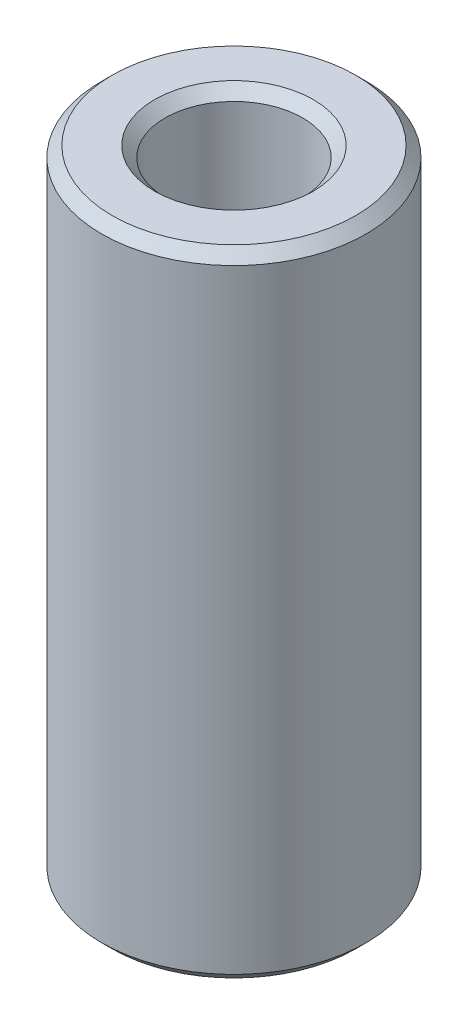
ISO-10303-21;
HEADER;
FILE_DESCRIPTION(('STEP AP214'),'2;1');
FILE_NAME('part.step','',(''),(''),'','','');
FILE_SCHEMA(('AUTOMOTIVE_DESIGN { 1 0 10303 214 1 1 1 1 }'));
ENDSEC;
DATA;
#1=APPLICATION_CONTEXT('core data for automotive mechanical design processes');
#2=APPLICATION_PROTOCOL_DEFINITION('international standard','automotive_design',2000,#1);
#3=PRODUCT_CONTEXT('',#1,'mechanical');
#4=PRODUCT('Part','Part','',(#3));
#5=PRODUCT_RELATED_PRODUCT_CATEGORY('part','',(#4));
#6=PRODUCT_DEFINITION_FORMATION('','',#4);
#7=PRODUCT_DEFINITION_CONTEXT('part definition',#1,'design');
#8=PRODUCT_DEFINITION('design','',#6,#7);
#9=PRODUCT_DEFINITION_SHAPE('','',#8);
#10=(LENGTH_UNIT() NAMED_UNIT(*) SI_UNIT(.MILLI.,.METRE.));
#11=(NAMED_UNIT(*) PLANE_ANGLE_UNIT() SI_UNIT($,.RADIAN.));
#12=(NAMED_UNIT(*) SI_UNIT($,.STERADIAN.) SOLID_ANGLE_UNIT());
#13=UNCERTAINTY_MEASURE_WITH_UNIT(LENGTH_MEASURE(1.E-05),#10,'distance_accuracy_value','');
#14=(GEOMETRIC_REPRESENTATION_CONTEXT(3) GLOBAL_UNCERTAINTY_ASSIGNED_CONTEXT((#13)) GLOBAL_UNIT_ASSIGNED_CONTEXT((#10,
#11,#12)) REPRESENTATION_CONTEXT('',''));
#15=CARTESIAN_POINT('',(0.,0.,0.));
#16=DIRECTION('',(0.,0.,1.));
#17=DIRECTION('',(1.,0.,0.));
#18=AXIS2_PLACEMENT_3D('',#15,#16,#17);
#19=CARTESIAN_POINT('',(0.,12.,0.));
#20=DIRECTION('',(0.,1.,0.));
#21=DIRECTION('',(0.,0.,1.));
#22=AXIS2_PLACEMENT_3D('',#19,#20,#21);
#23=PLANE('',#22);
#24=CARTESIAN_POINT('',(0.,12.,0.));
#25=DIRECTION('',(0.,1.,0.));
#26=DIRECTION('',(0.,0.,1.));
#27=AXIS2_PLACEMENT_3D('',#24,#25,#26);
#28=CIRCLE('',#27,2.3);
#29=CARTESIAN_POINT('',(0.,12.,2.3));
#30=VERTEX_POINT('',#29);
#31=EDGE_CURVE('E10',#30,#30,#28,.T.);
#32=ORIENTED_EDGE('',*,*,#31,.T.);
#33=EDGE_LOOP('',(#32));
#34=FACE_BOUND('',#33,.T.);
#35=CARTESIAN_POINT('',(0.,12.,0.));
#36=DIRECTION('',(0.,1.,0.));
#37=DIRECTION('',(0.,0.,1.));
#38=AXIS2_PLACEMENT_3D('',#35,#36,#37);
#39=CIRCLE('',#38,1.5);
#40=CARTESIAN_POINT('',(0.,12.,1.5));
#41=VERTEX_POINT('',#40);
#42=EDGE_CURVE('E38',#41,#41,#39,.F.);
#43=ORIENTED_EDGE('',*,*,#42,.T.);
#44=EDGE_LOOP('',(#43));
#45=FACE_BOUND('',#44,.T.);
#46=ADVANCED_FACE('F31',(#34,#45),#23,.T.);
#47=CARTESIAN_POINT('',(0.,0.,0.));
#48=DIRECTION('',(0.,1.,0.));
#49=DIRECTION('',(0.,0.,1.));
#50=AXIS2_PLACEMENT_3D('',#47,#48,#49);
#51=PLANE('',#50);
#52=CARTESIAN_POINT('',(0.,0.,0.));
#53=DIRECTION('',(0.,1.,0.));
#54=DIRECTION('',(0.,0.,1.));
#55=AXIS2_PLACEMENT_3D('',#52,#53,#54);
#56=CIRCLE('',#55,2.3);
#57=CARTESIAN_POINT('',(0.,0.,2.3));
#58=VERTEX_POINT('',#57);
#59=EDGE_CURVE('E51',#58,#58,#56,.F.);
#60=ORIENTED_EDGE('',*,*,#59,.T.);
#61=EDGE_LOOP('',(#60));
#62=FACE_BOUND('',#61,.T.);
#63=CARTESIAN_POINT('',(0.,0.,0.));
#64=DIRECTION('',(0.,1.,0.));
#65=DIRECTION('',(0.,0.,1.));
#66=AXIS2_PLACEMENT_3D('',#63,#64,#65);
#67=CIRCLE('',#66,1.5);
#68=CARTESIAN_POINT('',(0.,0.,1.5));
#69=VERTEX_POINT('',#68);
#70=EDGE_CURVE('E54',#69,#69,#67,.T.);
#71=ORIENTED_EDGE('',*,*,#70,.T.);
#72=EDGE_LOOP('',(#71));
#73=FACE_BOUND('',#72,.T.);
#74=ADVANCED_FACE('F79',(#62,#73),#51,.F.);
#75=CARTESIAN_POINT('',(0.,12.,0.));
#76=DIRECTION('',(0.,-1.,0.));
#77=DIRECTION('',(0.,0.,-1.));
#78=AXIS2_PLACEMENT_3D('',#75,#76,#77);
#79=CYLINDRICAL_SURFACE('',#78,2.5);
#80=CARTESIAN_POINT('',(0.,0.199999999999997,0.));
#81=DIRECTION('',(0.,1.,0.));
#82=DIRECTION('',(0.,0.,1.));
#83=AXIS2_PLACEMENT_3D('',#80,#81,#82);
#84=CIRCLE('',#83,2.5);
#85=CARTESIAN_POINT('',(0.,0.199999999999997,2.5));
#86=VERTEX_POINT('',#85);
#87=EDGE_CURVE('E57',#86,#86,#84,.T.);
#88=ORIENTED_EDGE('',*,*,#87,.T.);
#89=EDGE_LOOP('',(#88));
#90=FACE_BOUND('',#89,.T.);
#91=CARTESIAN_POINT('',(0.,11.8,0.));
#92=DIRECTION('',(0.,1.,0.));
#93=DIRECTION('',(0.,0.,1.));
#94=AXIS2_PLACEMENT_3D('',#91,#92,#93);
#95=CIRCLE('',#94,2.5);
#96=CARTESIAN_POINT('',(0.,11.8,2.5));
#97=VERTEX_POINT('',#96);
#98=EDGE_CURVE('E60',#97,#97,#95,.F.);
#99=ORIENTED_EDGE('',*,*,#98,.T.);
#100=EDGE_LOOP('',(#99));
#101=FACE_BOUND('',#100,.T.);
#102=ADVANCED_FACE('F64',(#90,#101),#79,.T.);
#103=CARTESIAN_POINT('',(0.,12.,0.));
#104=DIRECTION('',(0.,-1.,0.));
#105=DIRECTION('',(0.,0.,-1.));
#106=AXIS2_PLACEMENT_3D('',#103,#104,#105);
#107=CYLINDRICAL_SURFACE('',#106,1.3);
#108=CARTESIAN_POINT('',(0.,0.200000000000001,0.));
#109=DIRECTION('',(0.,1.,0.));
#110=DIRECTION('',(0.,0.,1.));
#111=AXIS2_PLACEMENT_3D('',#108,#109,#110);
#112=CIRCLE('',#111,1.3);
#113=CARTESIAN_POINT('',(0.,0.200000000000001,1.3));
#114=VERTEX_POINT('',#113);
#115=EDGE_CURVE('E42',#114,#114,#112,.F.);
#116=ORIENTED_EDGE('',*,*,#115,.T.);
#117=EDGE_LOOP('',(#116));
#118=FACE_BOUND('',#117,.T.);
#119=CARTESIAN_POINT('',(0.,11.8,0.));
#120=DIRECTION('',(0.,1.,0.));
#121=DIRECTION('',(0.,0.,1.));
#122=AXIS2_PLACEMENT_3D('',#119,#120,#121);
#123=CIRCLE('',#122,1.3);
#124=CARTESIAN_POINT('',(0.,11.8,1.3));
#125=VERTEX_POINT('',#124);
#126=EDGE_CURVE('E46',#125,#125,#123,.T.);
#127=ORIENTED_EDGE('',*,*,#126,.T.);
#128=EDGE_LOOP('',(#127));
#129=FACE_BOUND('',#128,.T.);
#130=ADVANCED_FACE('F87',(#118,#129),#107,.F.);
#131=CARTESIAN_POINT('',(0.,0.199999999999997,0.));
#132=DIRECTION('',(0.,1.,0.));
#133=DIRECTION('',(0.,0.,1.));
#134=AXIS2_PLACEMENT_3D('',#131,#132,#133);
#135=CONICAL_SURFACE('',#134,2.5,0.785398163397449);
#136=ORIENTED_EDGE('',*,*,#59,.F.);
#137=EDGE_LOOP('',(#136));
#138=FACE_BOUND('',#137,.T.);
#139=ORIENTED_EDGE('',*,*,#87,.F.);
#140=EDGE_LOOP('',(#139));
#141=FACE_BOUND('',#140,.T.);
#142=ADVANCED_FACE('F75',(#138,#141),#135,.T.);
#143=CARTESIAN_POINT('',(0.,0.,0.));
#144=DIRECTION('',(0.,-1.,0.));
#145=DIRECTION('',(0.,0.,-1.));
#146=AXIS2_PLACEMENT_3D('',#143,#144,#145);
#147=CONICAL_SURFACE('',#146,1.5,0.785398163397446);
#148=ORIENTED_EDGE('',*,*,#115,.F.);
#149=EDGE_LOOP('',(#148));
#150=FACE_BOUND('',#149,.T.);
#151=ORIENTED_EDGE('',*,*,#70,.F.);
#152=EDGE_LOOP('',(#151));
#153=FACE_BOUND('',#152,.T.);
#154=ADVANCED_FACE('F69',(#150,#153),#147,.F.);
#155=CARTESIAN_POINT('',(0.,12.,0.));
#156=DIRECTION('',(0.,-1.,0.));
#157=DIRECTION('',(0.,0.,-1.));
#158=AXIS2_PLACEMENT_3D('',#155,#156,#157);
#159=CONICAL_SURFACE('',#158,2.3,0.785398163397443);
#160=ORIENTED_EDGE('',*,*,#98,.F.);
#161=EDGE_LOOP('',(#160));
#162=FACE_BOUND('',#161,.T.);
#163=ORIENTED_EDGE('',*,*,#31,.F.);
#164=EDGE_LOOP('',(#163));
#165=FACE_BOUND('',#164,.T.);
#166=ADVANCED_FACE('F66',(#162,#165),#159,.T.);
#167=CARTESIAN_POINT('',(0.,11.8,0.));
#168=DIRECTION('',(0.,1.,0.));
#169=DIRECTION('',(0.,0.,1.));
#170=AXIS2_PLACEMENT_3D('',#167,#168,#169);
#171=CONICAL_SURFACE('',#170,1.3,0.78539816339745);
#172=ORIENTED_EDGE('',*,*,#42,.F.);
#173=EDGE_LOOP('',(#172));
#174=FACE_BOUND('',#173,.T.);
#175=ORIENTED_EDGE('',*,*,#126,.F.);
#176=EDGE_LOOP('',(#175));
#177=FACE_BOUND('',#176,.T.);
#178=ADVANCED_FACE('F33',(#174,#177),#171,.F.);
#179=CLOSED_SHELL('',(#46,#74,#102,#130,#142,#154,#166,#178));
#180=MANIFOLD_SOLID_BREP('B2',#179);
#181=ADVANCED_BREP_SHAPE_REPRESENTATION('',(#18,#180),#14);
#182=SHAPE_DEFINITION_REPRESENTATION(#9,#181);
ENDSEC;
END-ISO-10303-21;
